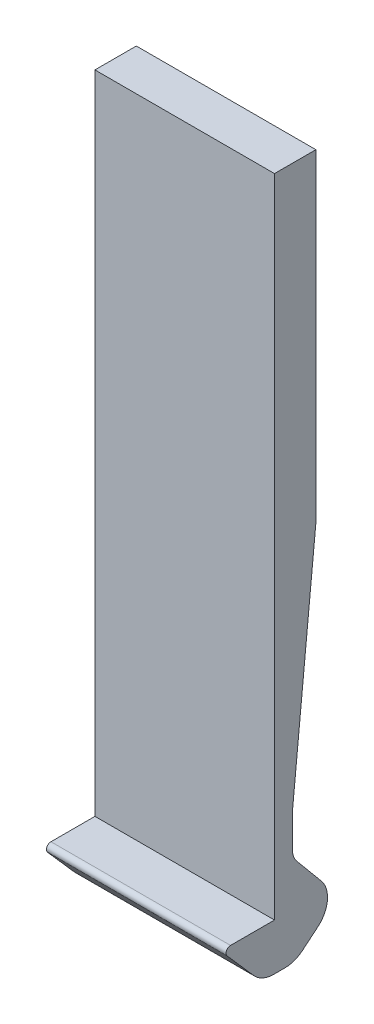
ISO-10303-21;
HEADER;
FILE_DESCRIPTION(('STEP AP214'),'2;1');
FILE_NAME('part.step','',(''),(''),'','','');
FILE_SCHEMA(('AUTOMOTIVE_DESIGN { 1 0 10303 214 1 1 1 1 }'));
ENDSEC;
DATA;
#1=APPLICATION_CONTEXT('core data for automotive mechanical design processes');
#2=APPLICATION_PROTOCOL_DEFINITION('international standard','automotive_design',2000,#1);
#3=PRODUCT_CONTEXT('',#1,'mechanical');
#4=PRODUCT('Part','Part','',(#3));
#5=PRODUCT_RELATED_PRODUCT_CATEGORY('part','',(#4));
#6=PRODUCT_DEFINITION_FORMATION('','',#4);
#7=PRODUCT_DEFINITION_CONTEXT('part definition',#1,'design');
#8=PRODUCT_DEFINITION('design','',#6,#7);
#9=PRODUCT_DEFINITION_SHAPE('','',#8);
#10=(LENGTH_UNIT() NAMED_UNIT(*) SI_UNIT(.MILLI.,.METRE.));
#11=(NAMED_UNIT(*) PLANE_ANGLE_UNIT() SI_UNIT($,.RADIAN.));
#12=(NAMED_UNIT(*) SI_UNIT($,.STERADIAN.) SOLID_ANGLE_UNIT());
#13=UNCERTAINTY_MEASURE_WITH_UNIT(LENGTH_MEASURE(1.E-05),#10,'distance_accuracy_value','');
#14=(GEOMETRIC_REPRESENTATION_CONTEXT(3) GLOBAL_UNCERTAINTY_ASSIGNED_CONTEXT((#13)) GLOBAL_UNIT_ASSIGNED_CONTEXT((#10,
#11,#12)) REPRESENTATION_CONTEXT('',''));
#15=CARTESIAN_POINT('',(0.,0.,0.));
#16=DIRECTION('',(0.,0.,1.));
#17=DIRECTION('',(1.,0.,0.));
#18=AXIS2_PLACEMENT_3D('',#15,#16,#17);
#19=CARTESIAN_POINT('',(44.4037144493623,0.,60.832));
#20=DIRECTION('',(0.,0.,1.));
#21=DIRECTION('',(1.,0.,0.));
#22=AXIS2_PLACEMENT_3D('',#19,#20,#21);
#23=PLANE('',#22);
#24=DIRECTION('',(0.,1.,0.));
#25=VECTOR('',#24,1.);
#26=CARTESIAN_POINT('',(-4.99999999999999,0.,60.832));
#27=LINE('',#26,#25);
#28=CARTESIAN_POINT('',(-4.99999999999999,-45.6301978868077,60.832));
#29=VERTEX_POINT('',#28);
#30=CARTESIAN_POINT('',(-4.99999999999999,-43.7995079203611,60.832));
#31=VERTEX_POINT('',#30);
#32=EDGE_CURVE('E167',#29,#31,#27,.T.);
#33=ORIENTED_EDGE('',*,*,#32,.T.);
#34=DIRECTION('',(-1.,0.,0.));
#35=VECTOR('',#34,1.);
#36=CARTESIAN_POINT('',(5.00000000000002,-43.7995079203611,60.832));
#37=LINE('',#36,#35);
#38=CARTESIAN_POINT('',(5.00000000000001,-43.7995079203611,60.832));
#39=VERTEX_POINT('',#38);
#40=EDGE_CURVE('E250',#31,#39,#37,.F.);
#41=ORIENTED_EDGE('',*,*,#40,.T.);
#42=DIRECTION('',(0.,1.,0.));
#43=VECTOR('',#42,1.);
#44=CARTESIAN_POINT('',(5.00000000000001,0.,60.832));
#45=LINE('',#44,#43);
#46=CARTESIAN_POINT('',(5.00000000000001,-45.6301978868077,60.832));
#47=VERTEX_POINT('',#46);
#48=EDGE_CURVE('E201',#47,#39,#45,.T.);
#49=ORIENTED_EDGE('',*,*,#48,.F.);
#50=DIRECTION('',(-1.,0.,0.));
#51=VECTOR('',#50,1.);
#52=CARTESIAN_POINT('',(-4.99999999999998,-45.6301978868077,60.832));
#53=LINE('',#52,#51);
#54=EDGE_CURVE('E247',#47,#29,#53,.T.);
#55=ORIENTED_EDGE('',*,*,#54,.T.);
#56=EDGE_LOOP('',(#33,#41,#49,#55));
#57=FACE_BOUND('',#56,.T.);
#58=ADVANCED_FACE('F35',(#57),#23,.F.);
#59=CARTESIAN_POINT('',(44.4037144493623,5.5130003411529,55.9805064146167));
#60=DIRECTION('',(0.,0.0980066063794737,0.995185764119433));
#61=DIRECTION('',(0.,-0.995185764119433,0.0980066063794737));
#62=AXIS2_PLACEMENT_3D('',#59,#60,#61);
#63=PLANE('',#62);
#64=DIRECTION('',(0.,0.995185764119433,-0.0980066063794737));
#65=VECTOR('',#64,1.);
#66=CARTESIAN_POINT('',(5.00000000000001,5.5130003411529,55.9805064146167));
#67=LINE('',#66,#65);
#68=CARTESIAN_POINT('',(5.00000000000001,-43.7015013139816,60.8271857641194));
#69=VERTEX_POINT('',#68);
#70=CARTESIAN_POINT('',(5.00000000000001,-30.5,59.5270924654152));
#71=VERTEX_POINT('',#70);
#72=EDGE_CURVE('E199',#69,#71,#67,.T.);
#73=ORIENTED_EDGE('',*,*,#72,.F.);
#74=DIRECTION('',(-1.,0.,0.));
#75=VECTOR('',#74,1.);
#76=CARTESIAN_POINT('',(-4.99999999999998,-43.7015013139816,60.8271857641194));
#77=LINE('',#76,#75);
#78=CARTESIAN_POINT('',(-4.99999999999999,-43.7015013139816,60.8271857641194));
#79=VERTEX_POINT('',#78);
#80=EDGE_CURVE('E155',#69,#79,#77,.T.);
#81=ORIENTED_EDGE('',*,*,#80,.T.);
#82=DIRECTION('',(0.,0.995185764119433,-0.0980066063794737));
#83=VECTOR('',#82,1.);
#84=CARTESIAN_POINT('',(-4.99999999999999,5.5130003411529,55.9805064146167));
#85=LINE('',#84,#83);
#86=CARTESIAN_POINT('',(-4.99999999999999,-30.5,59.5270924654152));
#87=VERTEX_POINT('',#86);
#88=EDGE_CURVE('E149',#79,#87,#85,.T.);
#89=ORIENTED_EDGE('',*,*,#88,.T.);
#90=DIRECTION('',(-1.,0.,0.));
#91=VECTOR('',#90,1.);
#92=CARTESIAN_POINT('',(44.4037144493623,-30.5,59.5270924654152));
#93=LINE('',#92,#91);
#94=EDGE_CURVE('E153',#71,#87,#93,.T.);
#95=ORIENTED_EDGE('',*,*,#94,.F.);
#96=EDGE_LOOP('',(#73,#81,#89,#95));
#97=FACE_BOUND('',#96,.T.);
#98=ADVANCED_FACE('F152',(#97),#63,.F.);
#99=CARTESIAN_POINT('',(44.4037144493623,0.,59.5270924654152));
#100=DIRECTION('',(0.,0.,1.));
#101=DIRECTION('',(1.,0.,0.));
#102=AXIS2_PLACEMENT_3D('',#99,#100,#101);
#103=PLANE('',#102);
#104=DIRECTION('',(0.,1.,0.));
#105=VECTOR('',#104,1.);
#106=CARTESIAN_POINT('',(5.00000000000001,0.,59.5270924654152));
#107=LINE('',#106,#105);
#108=CARTESIAN_POINT('',(5.00000000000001,-12.5,59.5270924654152));
#109=VERTEX_POINT('',#108);
#110=EDGE_CURVE('E165',#71,#109,#107,.T.);
#111=ORIENTED_EDGE('',*,*,#110,.F.);
#112=ORIENTED_EDGE('',*,*,#94,.T.);
#113=DIRECTION('',(0.,1.,0.));
#114=VECTOR('',#113,1.);
#115=CARTESIAN_POINT('',(-4.99999999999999,0.,59.5270924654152));
#116=LINE('',#115,#114);
#117=CARTESIAN_POINT('',(-4.99999999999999,-12.5,59.5270924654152));
#118=VERTEX_POINT('',#117);
#119=EDGE_CURVE('E157',#87,#118,#116,.T.);
#120=ORIENTED_EDGE('',*,*,#119,.T.);
#121=DIRECTION('',(-1.,0.,0.));
#122=VECTOR('',#121,1.);
#123=CARTESIAN_POINT('',(44.4037144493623,-12.5,59.5270924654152));
#124=LINE('',#123,#122);
#125=EDGE_CURVE('E166',#109,#118,#124,.T.);
#126=ORIENTED_EDGE('',*,*,#125,.F.);
#127=EDGE_LOOP('',(#111,#112,#120,#126));
#128=FACE_BOUND('',#127,.T.);
#129=ADVANCED_FACE('F162',(#128),#103,.F.);
#130=CARTESIAN_POINT('',(44.4037144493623,-12.5,0.));
#131=DIRECTION('',(0.,-1.,0.));
#132=DIRECTION('',(0.,0.,-1.));
#133=AXIS2_PLACEMENT_3D('',#130,#131,#132);
#134=PLANE('',#133);
#135=DIRECTION('',(0.,0.,1.));
#136=VECTOR('',#135,1.);
#137=CARTESIAN_POINT('',(5.00000000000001,-12.5,0.));
#138=LINE('',#137,#136);
#139=CARTESIAN_POINT('',(5.00000000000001,-12.5,61.832));
#140=VERTEX_POINT('',#139);
#141=EDGE_CURVE('E195',#109,#140,#138,.T.);
#142=ORIENTED_EDGE('',*,*,#141,.F.);
#143=ORIENTED_EDGE('',*,*,#125,.T.);
#144=DIRECTION('',(0.,0.,1.));
#145=VECTOR('',#144,1.);
#146=CARTESIAN_POINT('',(-4.99999999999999,-12.5,0.));
#147=LINE('',#146,#145);
#148=CARTESIAN_POINT('',(-4.99999999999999,-12.5,61.832));
#149=VERTEX_POINT('',#148);
#150=EDGE_CURVE('E173',#118,#149,#147,.T.);
#151=ORIENTED_EDGE('',*,*,#150,.T.);
#152=DIRECTION('',(-1.,0.,0.));
#153=VECTOR('',#152,1.);
#154=CARTESIAN_POINT('',(44.4037144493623,-12.5,61.832));
#155=LINE('',#154,#153);
#156=EDGE_CURVE('E208',#140,#149,#155,.T.);
#157=ORIENTED_EDGE('',*,*,#156,.F.);
#158=EDGE_LOOP('',(#142,#143,#151,#157));
#159=FACE_BOUND('',#158,.T.);
#160=ADVANCED_FACE('F288',(#159),#134,.F.);
#161=CARTESIAN_POINT('',(44.4037144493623,0.,61.832));
#162=DIRECTION('',(0.,0.,-1.));
#163=DIRECTION('',(-1.,0.,0.));
#164=AXIS2_PLACEMENT_3D('',#161,#162,#163);
#165=PLANE('',#164);
#166=DIRECTION('',(0.,-1.,0.));
#167=VECTOR('',#166,1.);
#168=CARTESIAN_POINT('',(5.00000000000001,0.,61.832));
#169=LINE('',#168,#167);
#170=CARTESIAN_POINT('',(5.00000000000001,-48.5,61.832));
#171=VERTEX_POINT('',#170);
#172=EDGE_CURVE('E192',#140,#171,#169,.T.);
#173=ORIENTED_EDGE('',*,*,#172,.F.);
#174=ORIENTED_EDGE('',*,*,#156,.T.);
#175=DIRECTION('',(0.,-1.,0.));
#176=VECTOR('',#175,1.);
#177=CARTESIAN_POINT('',(-4.99999999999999,0.,61.832));
#178=LINE('',#177,#176);
#179=CARTESIAN_POINT('',(-4.99999999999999,-48.5,61.832));
#180=VERTEX_POINT('',#179);
#181=EDGE_CURVE('E175',#149,#180,#178,.T.);
#182=ORIENTED_EDGE('',*,*,#181,.T.);
#183=DIRECTION('',(-1.,0.,0.));
#184=VECTOR('',#183,1.);
#185=CARTESIAN_POINT('',(44.4037144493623,-48.5,61.832));
#186=LINE('',#185,#184);
#187=EDGE_CURVE('E205',#171,#180,#186,.T.);
#188=ORIENTED_EDGE('',*,*,#187,.F.);
#189=EDGE_LOOP('',(#173,#174,#182,#188));
#190=FACE_BOUND('',#189,.T.);
#191=ADVANCED_FACE('F284',(#190),#165,.F.);
#192=CARTESIAN_POINT('',(44.4037144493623,-48.5,0.));
#193=DIRECTION('',(0.,-1.,0.));
#194=DIRECTION('',(0.,0.,-1.));
#195=AXIS2_PLACEMENT_3D('',#192,#193,#194);
#196=PLANE('',#195);
#197=DIRECTION('',(0.,0.,1.));
#198=VECTOR('',#197,1.);
#199=CARTESIAN_POINT('',(-4.99999999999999,-48.5,0.));
#200=LINE('',#199,#198);
#201=CARTESIAN_POINT('',(-4.99999999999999,-48.5,64.279943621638));
#202=VERTEX_POINT('',#201);
#203=EDGE_CURVE('E279',#180,#202,#200,.T.);
#204=ORIENTED_EDGE('',*,*,#203,.T.);
#205=DIRECTION('',(-1.,0.,0.));
#206=VECTOR('',#205,1.);
#207=CARTESIAN_POINT('',(44.4037144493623,-48.5,64.279943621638));
#208=LINE('',#207,#206);
#209=CARTESIAN_POINT('',(5.00000000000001,-48.5,64.279943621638));
#210=VERTEX_POINT('',#209);
#211=EDGE_CURVE('E215',#202,#210,#208,.F.);
#212=ORIENTED_EDGE('',*,*,#211,.T.);
#213=DIRECTION('',(0.,0.,1.));
#214=VECTOR('',#213,1.);
#215=CARTESIAN_POINT('',(5.00000000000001,-48.5,0.));
#216=LINE('',#215,#214);
#217=EDGE_CURVE('E189',#171,#210,#216,.T.);
#218=ORIENTED_EDGE('',*,*,#217,.F.);
#219=ORIENTED_EDGE('',*,*,#187,.T.);
#220=EDGE_LOOP('',(#204,#212,#218,#219));
#221=FACE_BOUND('',#220,.T.);
#222=ADVANCED_FACE('F440',(#221),#196,.F.);
#223=CARTESIAN_POINT('',(44.4037144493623,-53.2460982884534,60.6664130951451));
#224=DIRECTION('',(0.,0.659647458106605,-0.751575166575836));
#225=DIRECTION('',(0.,0.751575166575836,0.659647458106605));
#226=AXIS2_PLACEMENT_3D('',#223,#224,#225);
#227=PLANE('',#226);
#228=DIRECTION('',(0.,-0.751575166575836,-0.659647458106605));
#229=VECTOR('',#228,1.);
#230=CARTESIAN_POINT('',(-4.99999999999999,-53.2460982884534,60.6664130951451));
#231=LINE('',#230,#229);
#232=CARTESIAN_POINT('',(-4.99999999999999,-48.9149118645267,64.467837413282));
#233=VERTEX_POINT('',#232);
#234=CARTESIAN_POINT('',(-4.99999999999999,-50.5886499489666,62.9988199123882));
#235=VERTEX_POINT('',#234);
#236=EDGE_CURVE('E276',#233,#235,#231,.T.);
#237=ORIENTED_EDGE('',*,*,#236,.T.);
#238=DIRECTION('',(-1.,0.,0.));
#239=VECTOR('',#238,1.);
#240=CARTESIAN_POINT('',(44.4037144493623,-50.5886499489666,62.9988199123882));
#241=LINE('',#240,#239);
#242=CARTESIAN_POINT('',(5.00000000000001,-50.5886499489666,62.9988199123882));
#243=VERTEX_POINT('',#242);
#244=EDGE_CURVE('E244',#235,#243,#241,.F.);
#245=ORIENTED_EDGE('',*,*,#244,.T.);
#246=DIRECTION('',(0.,-0.751575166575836,-0.659647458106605));
#247=VECTOR('',#246,1.);
#248=CARTESIAN_POINT('',(5.00000000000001,-53.2460982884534,60.6664130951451));
#249=LINE('',#248,#247);
#250=CARTESIAN_POINT('',(5.00000000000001,-48.9149118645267,64.467837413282));
#251=VERTEX_POINT('',#250);
#252=EDGE_CURVE('E186',#251,#243,#249,.T.);
#253=ORIENTED_EDGE('',*,*,#252,.F.);
#254=DIRECTION('',(-1.,0.,0.));
#255=VECTOR('',#254,1.);
#256=CARTESIAN_POINT('',(44.4037144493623,-48.9149118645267,64.467837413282));
#257=LINE('',#256,#255);
#258=EDGE_CURVE('E182',#251,#233,#257,.T.);
#259=ORIENTED_EDGE('',*,*,#258,.T.);
#260=EDGE_LOOP('',(#237,#245,#253,#259));
#261=FACE_BOUND('',#260,.T.);
#262=ADVANCED_FACE('F298',(#261),#227,.F.);
#263=CARTESIAN_POINT('',(44.4037144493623,-51.0991787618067,0.));
#264=DIRECTION('',(0.,1.,0.));
#265=DIRECTION('',(0.,0.,1.));
#266=AXIS2_PLACEMENT_3D('',#263,#264,#265);
#267=PLANE('',#266);
#268=DIRECTION('',(0.,0.,-1.));
#269=VECTOR('',#268,1.);
#270=CARTESIAN_POINT('',(-4.99999999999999,-51.0991787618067,0.));
#271=LINE('',#270,#269);
#272=CARTESIAN_POINT('',(-4.99999999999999,-51.0991787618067,61.8714571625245));
#273=VERTEX_POINT('',#272);
#274=CARTESIAN_POINT('',(-4.99999999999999,-51.0991787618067,61.2407222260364));
#275=VERTEX_POINT('',#274);
#276=EDGE_CURVE('E273',#273,#275,#271,.T.);
#277=ORIENTED_EDGE('',*,*,#276,.T.);
#278=DIRECTION('',(-1.,0.,0.));
#279=VECTOR('',#278,1.);
#280=CARTESIAN_POINT('',(44.4037144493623,-51.0991787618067,61.2407222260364));
#281=LINE('',#280,#279);
#282=CARTESIAN_POINT('',(5.00000000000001,-51.0991787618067,61.2407222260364));
#283=VERTEX_POINT('',#282);
#284=EDGE_CURVE('E242',#275,#283,#281,.F.);
#285=ORIENTED_EDGE('',*,*,#284,.T.);
#286=DIRECTION('',(0.,0.,-1.));
#287=VECTOR('',#286,1.);
#288=CARTESIAN_POINT('',(5.00000000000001,-51.0991787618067,0.));
#289=LINE('',#288,#287);
#290=CARTESIAN_POINT('',(5.00000000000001,-51.0991787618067,61.8714571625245));
#291=VERTEX_POINT('',#290);
#292=EDGE_CURVE('E183',#291,#283,#289,.T.);
#293=ORIENTED_EDGE('',*,*,#292,.F.);
#294=DIRECTION('',(-1.,0.,0.));
#295=VECTOR('',#294,1.);
#296=CARTESIAN_POINT('',(44.4037144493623,-51.0991787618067,61.8714571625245));
#297=LINE('',#296,#295);
#298=EDGE_CURVE('E239',#291,#273,#297,.T.);
#299=ORIENTED_EDGE('',*,*,#298,.T.);
#300=EDGE_LOOP('',(#277,#285,#293,#299));
#301=FACE_BOUND('',#300,.T.);
#302=ADVANCED_FACE('F307',(#301),#267,.F.);
#303=CARTESIAN_POINT('',(44.4037144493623,-0.323609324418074,-0.269511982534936));
#304=DIRECTION('',(0.,0.768410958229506,0.639956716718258));
#305=DIRECTION('',(0.,-0.639956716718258,0.768410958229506));
#306=AXIS2_PLACEMENT_3D('',#303,#304,#305);
#307=PLANE('',#306);
#308=DIRECTION('',(0.,0.639956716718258,-0.768410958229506));
#309=VECTOR('',#308,1.);
#310=CARTESIAN_POINT('',(-4.99999999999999,-0.323609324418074,-0.269511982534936));
#311=LINE('',#310,#309);
#312=CARTESIAN_POINT('',(-4.99999999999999,-50.751795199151,60.2807871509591));
#313=VERTEX_POINT('',#312);
#314=CARTESIAN_POINT('',(-4.99999999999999,-50.0334735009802,59.4182815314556));
#315=VERTEX_POINT('',#314);
#316=EDGE_CURVE('E268',#313,#315,#311,.T.);
#317=ORIENTED_EDGE('',*,*,#316,.T.);
#318=DIRECTION('',(-1.,0.,0.));
#319=VECTOR('',#318,1.);
#320=CARTESIAN_POINT('',(44.4037144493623,-50.0334735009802,59.4182815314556));
#321=LINE('',#320,#319);
#322=CARTESIAN_POINT('',(5.00000000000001,-50.0334735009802,59.4182815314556));
#323=VERTEX_POINT('',#322);
#324=EDGE_CURVE('E231',#315,#323,#321,.F.);
#325=ORIENTED_EDGE('',*,*,#324,.T.);
#326=DIRECTION('',(0.,0.639956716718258,-0.768410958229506));
#327=VECTOR('',#326,1.);
#328=CARTESIAN_POINT('',(5.00000000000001,-0.323609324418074,-0.269511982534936));
#329=LINE('',#328,#327);
#330=CARTESIAN_POINT('',(5.00000000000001,-50.751795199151,60.280787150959));
#331=VERTEX_POINT('',#330);
#332=EDGE_CURVE('E179',#331,#323,#329,.T.);
#333=ORIENTED_EDGE('',*,*,#332,.F.);
#334=DIRECTION('',(-1.,0.,0.));
#335=VECTOR('',#334,1.);
#336=CARTESIAN_POINT('',(44.4037144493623,-50.751795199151,60.280787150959));
#337=LINE('',#336,#335);
#338=EDGE_CURVE('E228',#331,#313,#337,.T.);
#339=ORIENTED_EDGE('',*,*,#338,.T.);
#340=EDGE_LOOP('',(#317,#325,#333,#339));
#341=FACE_BOUND('',#340,.T.);
#342=ADVANCED_FACE('F316',(#341),#307,.F.);
#343=CARTESIAN_POINT('',(44.4037144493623,-48.7499291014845,58.5351770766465));
#344=DIRECTION('',(0.,-0.639956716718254,0.768410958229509));
#345=DIRECTION('',(0.,-0.768410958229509,-0.639956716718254));
#346=AXIS2_PLACEMENT_3D('',#343,#344,#345);
#347=PLANE('',#346);
#348=DIRECTION('',(0.,0.768410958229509,0.639956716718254));
#349=VECTOR('',#348,1.);
#350=CARTESIAN_POINT('',(-4.99999999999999,-48.7499291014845,58.5351770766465));
#351=LINE('',#350,#349);
#352=CARTESIAN_POINT('',(-4.99999999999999,-47.9209219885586,59.2256001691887));
#353=VERTEX_POINT('',#352);
#354=CARTESIAN_POINT('',(-4.99999999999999,-46.2701546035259,60.6004109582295));
#355=VERTEX_POINT('',#354);
#356=EDGE_CURVE('E266',#353,#355,#351,.T.);
#357=ORIENTED_EDGE('',*,*,#356,.T.);
#358=DIRECTION('',(-1.,0.,0.));
#359=VECTOR('',#358,1.);
#360=CARTESIAN_POINT('',(5.00000000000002,-46.2701546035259,60.6004109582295));
#361=LINE('',#360,#359);
#362=CARTESIAN_POINT('',(5.00000000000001,-46.2701546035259,60.6004109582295));
#363=VERTEX_POINT('',#362);
#364=EDGE_CURVE('E56',#355,#363,#361,.F.);
#365=ORIENTED_EDGE('',*,*,#364,.T.);
#366=DIRECTION('',(0.,0.768410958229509,0.639956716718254));
#367=VECTOR('',#366,1.);
#368=CARTESIAN_POINT('',(5.00000000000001,-48.7499291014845,58.5351770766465));
#369=LINE('',#368,#367);
#370=CARTESIAN_POINT('',(5.00000000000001,-47.9209219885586,59.2256001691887));
#371=VERTEX_POINT('',#370);
#372=EDGE_CURVE('E204',#371,#363,#369,.T.);
#373=ORIENTED_EDGE('',*,*,#372,.F.);
#374=DIRECTION('',(-1.,0.,0.));
#375=VECTOR('',#374,1.);
#376=CARTESIAN_POINT('',(44.4037144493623,-47.9209219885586,59.2256001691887));
#377=LINE('',#376,#375);
#378=EDGE_CURVE('E219',#371,#353,#377,.T.);
#379=ORIENTED_EDGE('',*,*,#378,.T.);
#380=EDGE_LOOP('',(#357,#365,#373,#379));
#381=FACE_BOUND('',#380,.T.);
#382=ADVANCED_FACE('F322',(#381),#347,.F.);
#383=CARTESIAN_POINT('',(5.00000000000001,-12.5,59.332));
#384=DIRECTION('',(1.,0.,0.));
#385=DIRECTION('',(0.,0.,-1.));
#386=AXIS2_PLACEMENT_3D('',#383,#384,#385);
#387=PLANE('',#386);
#388=ORIENTED_EDGE('',*,*,#332,.T.);
#389=CARTESIAN_POINT('',(5.00000000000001,-48.8808570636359,60.378216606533));
#390=DIRECTION('',(1.,0.,0.));
#391=DIRECTION('',(0.,0.,-1.));
#392=AXIS2_PLACEMENT_3D('',#389,#390,#391);
#393=CIRCLE('',#392,1.5);
#394=EDGE_CURVE('E237',#323,#371,#393,.T.);
#395=ORIENTED_EDGE('',*,*,#394,.T.);
#396=ORIENTED_EDGE('',*,*,#372,.T.);
#397=CARTESIAN_POINT('',(5.00000000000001,-45.6301978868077,59.832));
#398=DIRECTION('',(1.,0.,0.));
#399=DIRECTION('',(0.,0.,-1.));
#400=AXIS2_PLACEMENT_3D('',#397,#398,#399);
#401=CIRCLE('',#400,1.);
#402=EDGE_CURVE('E11',#363,#47,#401,.F.);
#403=ORIENTED_EDGE('',*,*,#402,.T.);
#404=ORIENTED_EDGE('',*,*,#48,.T.);
#405=CARTESIAN_POINT('',(5.00000000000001,-43.7995079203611,59.832));
#406=DIRECTION('',(1.,0.,0.));
#407=DIRECTION('',(0.,0.,-1.));
#408=AXIS2_PLACEMENT_3D('',#405,#406,#407);
#409=CIRCLE('',#408,1.);
#410=EDGE_CURVE('E255',#39,#69,#409,.F.);
#411=ORIENTED_EDGE('',*,*,#410,.T.);
#412=ORIENTED_EDGE('',*,*,#72,.T.);
#413=ORIENTED_EDGE('',*,*,#110,.T.);
#414=ORIENTED_EDGE('',*,*,#141,.T.);
#415=ORIENTED_EDGE('',*,*,#172,.T.);
#416=ORIENTED_EDGE('',*,*,#217,.T.);
#417=CARTESIAN_POINT('',(5.00000000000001,-48.75,64.279943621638));
#418=DIRECTION('',(1.,0.,0.));
#419=DIRECTION('',(0.,0.,-1.));
#420=AXIS2_PLACEMENT_3D('',#417,#418,#419);
#421=CIRCLE('',#420,0.25);
#422=EDGE_CURVE('E217',#210,#251,#421,.T.);
#423=ORIENTED_EDGE('',*,*,#422,.T.);
#424=ORIENTED_EDGE('',*,*,#252,.T.);
#425=CARTESIAN_POINT('',(5.00000000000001,-49.5991787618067,61.8714571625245));
#426=DIRECTION('',(1.,0.,0.));
#427=DIRECTION('',(0.,0.,-1.));
#428=AXIS2_PLACEMENT_3D('',#425,#426,#427);
#429=CIRCLE('',#428,1.5);
#430=EDGE_CURVE('E233',#243,#291,#429,.T.);
#431=ORIENTED_EDGE('',*,*,#430,.T.);
#432=ORIENTED_EDGE('',*,*,#292,.T.);
#433=CARTESIAN_POINT('',(5.00000000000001,-49.5991787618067,61.2407222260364));
#434=DIRECTION('',(1.,0.,0.));
#435=DIRECTION('',(0.,0.,-1.));
#436=AXIS2_PLACEMENT_3D('',#433,#434,#435);
#437=CIRCLE('',#436,1.5);
#438=EDGE_CURVE('E235',#283,#331,#437,.T.);
#439=ORIENTED_EDGE('',*,*,#438,.T.);
#440=EDGE_LOOP('',(#388,#395,#396,#403,#404,#411,#412,#413,#414,#415,#416,#423,#424,#431,#432,#439));
#441=FACE_BOUND('',#440,.T.);
#442=ADVANCED_FACE('F258',(#441),#387,.T.);
#443=CARTESIAN_POINT('',(-4.99999999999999,-12.5,59.332));
#444=DIRECTION('',(-1.,0.,0.));
#445=DIRECTION('',(0.,0.,1.));
#446=AXIS2_PLACEMENT_3D('',#443,#444,#445);
#447=PLANE('',#446);
#448=ORIENTED_EDGE('',*,*,#356,.F.);
#449=CARTESIAN_POINT('',(-4.99999999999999,-48.8808570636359,60.378216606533));
#450=DIRECTION('',(-1.,0.,0.));
#451=DIRECTION('',(0.,0.,1.));
#452=AXIS2_PLACEMENT_3D('',#449,#450,#451);
#453=CIRCLE('',#452,1.5);
#454=EDGE_CURVE('E226',#353,#315,#453,.T.);
#455=ORIENTED_EDGE('',*,*,#454,.T.);
#456=ORIENTED_EDGE('',*,*,#316,.F.);
#457=CARTESIAN_POINT('',(-4.99999999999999,-49.5991787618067,61.2407222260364));
#458=DIRECTION('',(-1.,0.,0.));
#459=DIRECTION('',(0.,0.,1.));
#460=AXIS2_PLACEMENT_3D('',#457,#458,#459);
#461=CIRCLE('',#460,1.5);
#462=EDGE_CURVE('E224',#313,#275,#461,.T.);
#463=ORIENTED_EDGE('',*,*,#462,.T.);
#464=ORIENTED_EDGE('',*,*,#276,.F.);
#465=CARTESIAN_POINT('',(-4.99999999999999,-49.5991787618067,61.8714571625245));
#466=DIRECTION('',(-1.,0.,0.));
#467=DIRECTION('',(0.,0.,1.));
#468=AXIS2_PLACEMENT_3D('',#465,#466,#467);
#469=CIRCLE('',#468,1.5);
#470=EDGE_CURVE('E222',#273,#235,#469,.T.);
#471=ORIENTED_EDGE('',*,*,#470,.T.);
#472=ORIENTED_EDGE('',*,*,#236,.F.);
#473=CARTESIAN_POINT('',(-4.99999999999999,-48.75,64.279943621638));
#474=DIRECTION('',(-1.,0.,0.));
#475=DIRECTION('',(0.,0.,1.));
#476=AXIS2_PLACEMENT_3D('',#473,#474,#475);
#477=CIRCLE('',#476,0.25);
#478=EDGE_CURVE('E213',#233,#202,#477,.T.);
#479=ORIENTED_EDGE('',*,*,#478,.T.);
#480=ORIENTED_EDGE('',*,*,#203,.F.);
#481=ORIENTED_EDGE('',*,*,#181,.F.);
#482=ORIENTED_EDGE('',*,*,#150,.F.);
#483=ORIENTED_EDGE('',*,*,#119,.F.);
#484=ORIENTED_EDGE('',*,*,#88,.F.);
#485=CARTESIAN_POINT('',(-4.99999999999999,-43.7995079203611,59.832));
#486=DIRECTION('',(-1.,0.,0.));
#487=DIRECTION('',(0.,0.,1.));
#488=AXIS2_PLACEMENT_3D('',#485,#486,#487);
#489=CIRCLE('',#488,1.);
#490=EDGE_CURVE('E253',#79,#31,#489,.F.);
#491=ORIENTED_EDGE('',*,*,#490,.T.);
#492=ORIENTED_EDGE('',*,*,#32,.F.);
#493=CARTESIAN_POINT('',(-4.99999999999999,-45.6301978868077,59.832));
#494=DIRECTION('',(-1.,0.,0.));
#495=DIRECTION('',(0.,0.,1.));
#496=AXIS2_PLACEMENT_3D('',#493,#494,#495);
#497=CIRCLE('',#496,1.);
#498=EDGE_CURVE('E43',#29,#355,#497,.F.);
#499=ORIENTED_EDGE('',*,*,#498,.T.);
#500=EDGE_LOOP('',(#448,#455,#456,#463,#464,#471,#472,#479,#480,#481,#482,#483,#484,#491,#492,#499));
#501=FACE_BOUND('',#500,.T.);
#502=ADVANCED_FACE('F170',(#501),#447,.T.);
#503=CARTESIAN_POINT('',(44.4037144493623,-48.75,64.279943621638));
#504=DIRECTION('',(-1.,0.,0.));
#505=DIRECTION('',(0.,0.,1.));
#506=AXIS2_PLACEMENT_3D('',#503,#504,#505);
#507=CYLINDRICAL_SURFACE('',#506,0.25);
#508=ORIENTED_EDGE('',*,*,#422,.F.);
#509=ORIENTED_EDGE('',*,*,#211,.F.);
#510=ORIENTED_EDGE('',*,*,#478,.F.);
#511=ORIENTED_EDGE('',*,*,#258,.F.);
#512=EDGE_LOOP('',(#508,#509,#510,#511));
#513=FACE_BOUND('',#512,.T.);
#514=ADVANCED_FACE('F295',(#513),#507,.T.);
#515=CARTESIAN_POINT('',(44.4037144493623,-48.8808570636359,60.378216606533));
#516=DIRECTION('',(-1.,0.,0.));
#517=DIRECTION('',(0.,0.,1.));
#518=AXIS2_PLACEMENT_3D('',#515,#516,#517);
#519=CYLINDRICAL_SURFACE('',#518,1.5);
#520=ORIENTED_EDGE('',*,*,#394,.F.);
#521=ORIENTED_EDGE('',*,*,#324,.F.);
#522=ORIENTED_EDGE('',*,*,#454,.F.);
#523=ORIENTED_EDGE('',*,*,#378,.F.);
#524=EDGE_LOOP('',(#520,#521,#522,#523));
#525=FACE_BOUND('',#524,.T.);
#526=ADVANCED_FACE('F321',(#525),#519,.T.);
#527=CARTESIAN_POINT('',(44.4037144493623,-49.5991787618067,61.2407222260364));
#528=DIRECTION('',(-1.,0.,0.));
#529=DIRECTION('',(0.,0.,1.));
#530=AXIS2_PLACEMENT_3D('',#527,#528,#529);
#531=CYLINDRICAL_SURFACE('',#530,1.5);
#532=ORIENTED_EDGE('',*,*,#438,.F.);
#533=ORIENTED_EDGE('',*,*,#284,.F.);
#534=ORIENTED_EDGE('',*,*,#462,.F.);
#535=ORIENTED_EDGE('',*,*,#338,.F.);
#536=EDGE_LOOP('',(#532,#533,#534,#535));
#537=FACE_BOUND('',#536,.T.);
#538=ADVANCED_FACE('F313',(#537),#531,.T.);
#539=CARTESIAN_POINT('',(44.4037144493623,-49.5991787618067,61.8714571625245));
#540=DIRECTION('',(-1.,0.,0.));
#541=DIRECTION('',(0.,0.,1.));
#542=AXIS2_PLACEMENT_3D('',#539,#540,#541);
#543=CYLINDRICAL_SURFACE('',#542,1.5);
#544=ORIENTED_EDGE('',*,*,#430,.F.);
#545=ORIENTED_EDGE('',*,*,#244,.F.);
#546=ORIENTED_EDGE('',*,*,#470,.F.);
#547=ORIENTED_EDGE('',*,*,#298,.F.);
#548=EDGE_LOOP('',(#544,#545,#546,#547));
#549=FACE_BOUND('',#548,.T.);
#550=ADVANCED_FACE('F304',(#549),#543,.T.);
#551=CARTESIAN_POINT('',(44.4037144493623,-43.7995079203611,59.832));
#552=DIRECTION('',(1.,0.,0.));
#553=DIRECTION('',(0.,0.,-1.));
#554=AXIS2_PLACEMENT_3D('',#551,#552,#553);
#555=CYLINDRICAL_SURFACE('',#554,1.);
#556=ORIENTED_EDGE('',*,*,#410,.F.);
#557=ORIENTED_EDGE('',*,*,#40,.F.);
#558=ORIENTED_EDGE('',*,*,#490,.F.);
#559=ORIENTED_EDGE('',*,*,#80,.F.);
#560=EDGE_LOOP('',(#556,#557,#558,#559));
#561=FACE_BOUND('',#560,.T.);
#562=ADVANCED_FACE('F262',(#561),#555,.F.);
#563=CARTESIAN_POINT('',(44.4037144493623,-45.6301978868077,59.832));
#564=DIRECTION('',(1.,0.,0.));
#565=DIRECTION('',(0.,0.,-1.));
#566=AXIS2_PLACEMENT_3D('',#563,#564,#565);
#567=CYLINDRICAL_SURFACE('',#566,1.);
#568=ORIENTED_EDGE('',*,*,#402,.F.);
#569=ORIENTED_EDGE('',*,*,#364,.F.);
#570=ORIENTED_EDGE('',*,*,#498,.F.);
#571=ORIENTED_EDGE('',*,*,#54,.F.);
#572=EDGE_LOOP('',(#568,#569,#570,#571));
#573=FACE_BOUND('',#572,.T.);
#574=ADVANCED_FACE('F37',(#573),#567,.F.);
#575=CLOSED_SHELL('',(#58,#98,#129,#160,#191,#222,#262,#302,#342,#382,#442,#502,#514,#526,#538,
#550,#562,#574));
#576=MANIFOLD_SOLID_BREP('B2',#575);
#577=ADVANCED_BREP_SHAPE_REPRESENTATION('',(#18,#576),#14);
#578=SHAPE_DEFINITION_REPRESENTATION(#9,#577);
ENDSEC;
END-ISO-10303-21;
